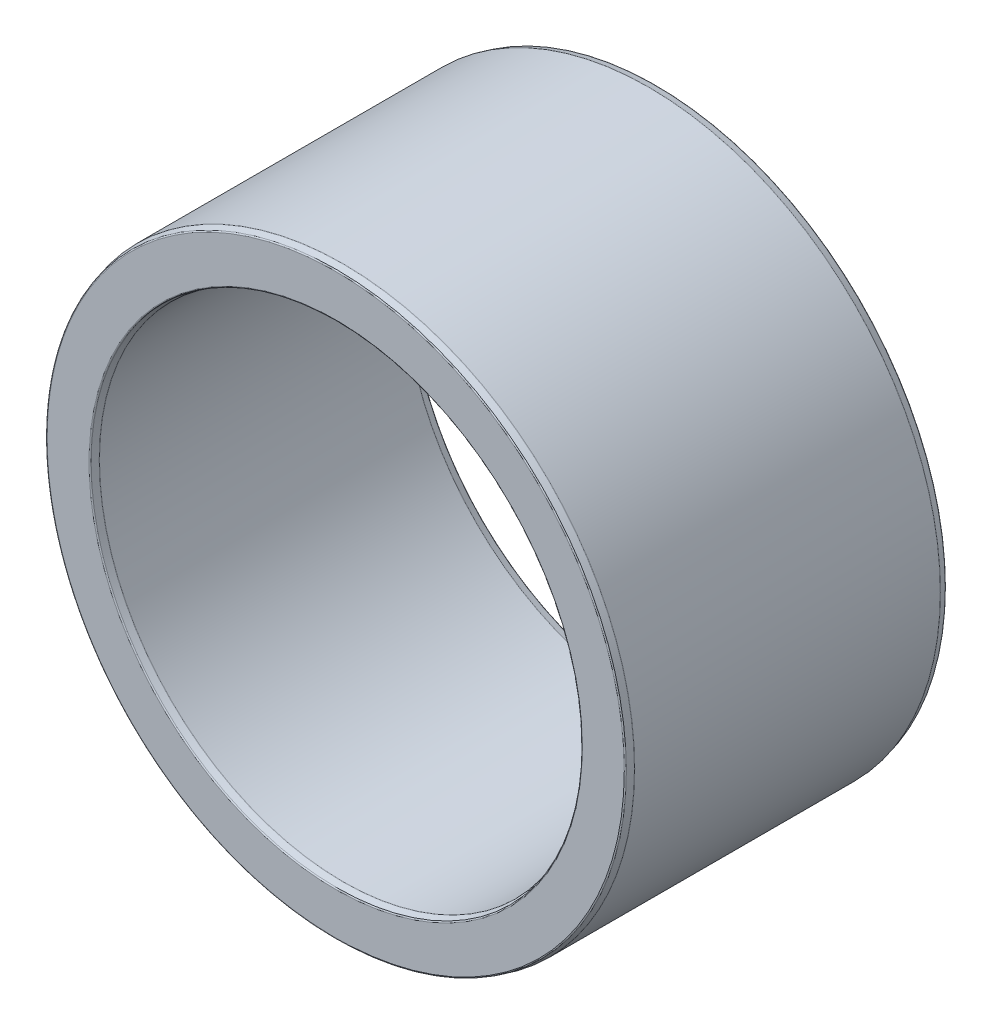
ISO-10303-21;
HEADER;
FILE_DESCRIPTION(('STEP AP214'),'2;1');
FILE_NAME('part.step','',(''),(''),'','','');
FILE_SCHEMA(('AUTOMOTIVE_DESIGN { 1 0 10303 214 1 1 1 1 }'));
ENDSEC;
DATA;
#1=APPLICATION_CONTEXT('core data for automotive mechanical design processes');
#2=APPLICATION_PROTOCOL_DEFINITION('international standard','automotive_design',2000,#1);
#3=PRODUCT_CONTEXT('',#1,'mechanical');
#4=PRODUCT('Part','Part','',(#3));
#5=PRODUCT_RELATED_PRODUCT_CATEGORY('part','',(#4));
#6=PRODUCT_DEFINITION_FORMATION('','',#4);
#7=PRODUCT_DEFINITION_CONTEXT('part definition',#1,'design');
#8=PRODUCT_DEFINITION('design','',#6,#7);
#9=PRODUCT_DEFINITION_SHAPE('','',#8);
#10=(LENGTH_UNIT() NAMED_UNIT(*) SI_UNIT(.MILLI.,.METRE.));
#11=(NAMED_UNIT(*) PLANE_ANGLE_UNIT() SI_UNIT($,.RADIAN.));
#12=(NAMED_UNIT(*) SI_UNIT($,.STERADIAN.) SOLID_ANGLE_UNIT());
#13=UNCERTAINTY_MEASURE_WITH_UNIT(LENGTH_MEASURE(1.E-05),#10,'distance_accuracy_value','');
#14=(GEOMETRIC_REPRESENTATION_CONTEXT(3) GLOBAL_UNCERTAINTY_ASSIGNED_CONTEXT((#13)) GLOBAL_UNIT_ASSIGNED_CONTEXT((#10,
#11,#12)) REPRESENTATION_CONTEXT('',''));
#15=CARTESIAN_POINT('',(0.,0.,0.));
#16=DIRECTION('',(0.,0.,1.));
#17=DIRECTION('',(1.,0.,0.));
#18=AXIS2_PLACEMENT_3D('',#15,#16,#17);
#19=CARTESIAN_POINT('',(0.,0.,16.4973));
#20=DIRECTION('',(0.,0.,1.));
#21=DIRECTION('',(1.,0.,0.));
#22=AXIS2_PLACEMENT_3D('',#19,#20,#21);
#23=PLANE('',#22);
#24=CARTESIAN_POINT('',(0.,0.,16.4973));
#25=DIRECTION('',(0.,0.,1.));
#26=DIRECTION('',(1.,0.,0.));
#27=AXIS2_PLACEMENT_3D('',#24,#25,#26);
#28=CIRCLE('',#27,29.6983721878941);
#29=CARTESIAN_POINT('',(29.6983721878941,0.,16.4973));
#30=VERTEX_POINT('',#29);
#31=EDGE_CURVE('E49',#30,#30,#28,.T.);
#32=ORIENTED_EDGE('',*,*,#31,.T.);
#33=EDGE_LOOP('',(#32));
#34=FACE_BOUND('',#33,.T.);
#35=CARTESIAN_POINT('',(0.,0.,16.4973));
#36=DIRECTION('',(0.,0.,1.));
#37=DIRECTION('',(1.,0.,0.));
#38=AXIS2_PLACEMENT_3D('',#35,#36,#37);
#39=CIRCLE('',#38,25.3866278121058);
#40=CARTESIAN_POINT('',(25.3866278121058,0.,16.4973));
#41=VERTEX_POINT('',#40);
#42=EDGE_CURVE('E54',#41,#41,#39,.F.);
#43=ORIENTED_EDGE('',*,*,#42,.T.);
#44=EDGE_LOOP('',(#43));
#45=FACE_BOUND('',#44,.T.);
#46=ADVANCED_FACE('F34',(#34,#45),#23,.T.);
#47=CARTESIAN_POINT('',(0.,0.,-16.4973));
#48=DIRECTION('',(0.,0.,1.));
#49=DIRECTION('',(1.,0.,0.));
#50=AXIS2_PLACEMENT_3D('',#47,#48,#49);
#51=PLANE('',#50);
#52=CARTESIAN_POINT('',(0.,0.,-16.4973));
#53=DIRECTION('',(0.,0.,1.));
#54=DIRECTION('',(1.,0.,0.));
#55=AXIS2_PLACEMENT_3D('',#52,#53,#54);
#56=CIRCLE('',#55,25.3866278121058);
#57=CARTESIAN_POINT('',(25.3866278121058,0.,-16.4973));
#58=VERTEX_POINT('',#57);
#59=EDGE_CURVE('E98',#58,#58,#56,.T.);
#60=ORIENTED_EDGE('',*,*,#59,.T.);
#61=EDGE_LOOP('',(#60));
#62=FACE_BOUND('',#61,.T.);
#63=CARTESIAN_POINT('',(0.,0.,-16.4973));
#64=DIRECTION('',(0.,0.,1.));
#65=DIRECTION('',(1.,0.,0.));
#66=AXIS2_PLACEMENT_3D('',#63,#64,#65);
#67=CIRCLE('',#66,29.6983721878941);
#68=CARTESIAN_POINT('',(29.6983721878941,0.,-16.4973));
#69=VERTEX_POINT('',#68);
#70=EDGE_CURVE('E102',#69,#69,#67,.F.);
#71=ORIENTED_EDGE('',*,*,#70,.T.);
#72=EDGE_LOOP('',(#71));
#73=FACE_BOUND('',#72,.T.);
#74=ADVANCED_FACE('F107',(#62,#73),#51,.F.);
#75=CARTESIAN_POINT('',(0.,0.,16.4973));
#76=DIRECTION('',(0.,0.,-1.));
#77=DIRECTION('',(-1.,0.,0.));
#78=AXIS2_PLACEMENT_3D('',#75,#76,#77);
#79=CYLINDRICAL_SURFACE('',#78,30.);
#80=CARTESIAN_POINT('',(0.,0.,-15.7185801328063));
#81=DIRECTION('',(0.,0.,-1.));
#82=DIRECTION('',(-1.,0.,0.));
#83=AXIS2_PLACEMENT_3D('',#80,#81,#82);
#84=CIRCLE('',#83,30.);
#85=CARTESIAN_POINT('',(-30.,0.,-15.7185801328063));
#86=VERTEX_POINT('',#85);
#87=EDGE_CURVE('E75',#86,#86,#84,.F.);
#88=ORIENTED_EDGE('',*,*,#87,.T.);
#89=EDGE_LOOP('',(#88));
#90=FACE_BOUND('',#89,.T.);
#91=CARTESIAN_POINT('',(0.,0.,15.7185801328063));
#92=DIRECTION('',(0.,0.,1.));
#93=DIRECTION('',(1.,0.,0.));
#94=AXIS2_PLACEMENT_3D('',#91,#92,#93);
#95=CIRCLE('',#94,30.);
#96=CARTESIAN_POINT('',(30.,0.,15.7185801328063));
#97=VERTEX_POINT('',#96);
#98=EDGE_CURVE('E79',#97,#97,#95,.F.);
#99=ORIENTED_EDGE('',*,*,#98,.T.);
#100=EDGE_LOOP('',(#99));
#101=FACE_BOUND('',#100,.T.);
#102=ADVANCED_FACE('F132',(#90,#101),#79,.T.);
#103=CARTESIAN_POINT('',(0.,0.,16.4973));
#104=DIRECTION('',(0.,0.,-1.));
#105=DIRECTION('',(-1.,0.,0.));
#106=AXIS2_PLACEMENT_3D('',#103,#104,#105);
#107=CYLINDRICAL_SURFACE('',#106,25.085);
#108=CARTESIAN_POINT('',(0.,0.,-15.7185801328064));
#109=DIRECTION('',(0.,0.,1.));
#110=DIRECTION('',(1.,0.,0.));
#111=AXIS2_PLACEMENT_3D('',#108,#109,#110);
#112=CIRCLE('',#111,25.085);
#113=CARTESIAN_POINT('',(25.085,0.,-15.7185801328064));
#114=VERTEX_POINT('',#113);
#115=EDGE_CURVE('E83',#114,#114,#112,.F.);
#116=ORIENTED_EDGE('',*,*,#115,.T.);
#117=EDGE_LOOP('',(#116));
#118=FACE_BOUND('',#117,.T.);
#119=CARTESIAN_POINT('',(0.,0.,15.7185801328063));
#120=DIRECTION('',(0.,0.,-1.));
#121=DIRECTION('',(-1.,0.,0.));
#122=AXIS2_PLACEMENT_3D('',#119,#120,#121);
#123=CIRCLE('',#122,25.085);
#124=CARTESIAN_POINT('',(-25.085,0.,15.7185801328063));
#125=VERTEX_POINT('',#124);
#126=EDGE_CURVE('E87',#125,#125,#123,.F.);
#127=ORIENTED_EDGE('',*,*,#126,.T.);
#128=EDGE_LOOP('',(#127));
#129=FACE_BOUND('',#128,.T.);
#130=ADVANCED_FACE('F137',(#118,#129),#107,.F.);
#131=CARTESIAN_POINT('',(0.,0.,15.7352999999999));
#132=DIRECTION('',(0.,0.,1.));
#133=DIRECTION('',(1.,0.,0.));
#134=AXIS2_PLACEMENT_3D('',#131,#132,#133);
#135=CONICAL_SURFACE('',#134,25.085,0.261799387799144);
#136=CARTESIAN_POINT('',(0.,0.,15.7514501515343));
#137=DIRECTION('',(0.,0.,-1.));
#138=DIRECTION('',(-1.,0.,0.));
#139=AXIS2_PLACEMENT_3D('',#136,#137,#138);
#140=CIRCLE('',#139,25.0893274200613);
#141=CARTESIAN_POINT('',(-25.0893274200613,0.,15.7514501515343));
#142=VERTEX_POINT('',#141);
#143=EDGE_CURVE('E10',#142,#142,#140,.T.);
#144=ORIENTED_EDGE('',*,*,#143,.T.);
#145=EDGE_LOOP('',(#144));
#146=FACE_BOUND('',#145,.T.);
#147=CARTESIAN_POINT('',(0.,0.,16.403170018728));
#148=DIRECTION('',(0.,0.,-1.));
#149=DIRECTION('',(-1.,0.,0.));
#150=AXIS2_PLACEMENT_3D('',#147,#148,#149);
#151=CIRCLE('',#150,25.2639552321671);
#152=CARTESIAN_POINT('',(-25.2639552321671,0.,16.403170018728));
#153=VERTEX_POINT('',#152);
#154=EDGE_CURVE('E42',#153,#153,#151,.F.);
#155=ORIENTED_EDGE('',*,*,#154,.T.);
#156=EDGE_LOOP('',(#155));
#157=FACE_BOUND('',#156,.T.);
#158=ADVANCED_FACE('F142',(#146,#157),#135,.F.);
#159=CARTESIAN_POINT('',(0.,0.,-15.7352999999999));
#160=DIRECTION('',(0.,0.,1.));
#161=DIRECTION('',(1.,0.,0.));
#162=AXIS2_PLACEMENT_3D('',#159,#160,#161);
#163=CONICAL_SURFACE('',#162,30.,0.261799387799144);
#164=CARTESIAN_POINT('',(0.,0.,-15.7514501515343));
#165=DIRECTION('',(0.,0.,1.));
#166=DIRECTION('',(1.,0.,0.));
#167=AXIS2_PLACEMENT_3D('',#164,#165,#166);
#168=CIRCLE('',#167,29.9956725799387);
#169=CARTESIAN_POINT('',(29.9956725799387,0.,-15.7514501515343));
#170=VERTEX_POINT('',#169);
#171=EDGE_CURVE('E67',#170,#170,#168,.F.);
#172=ORIENTED_EDGE('',*,*,#171,.T.);
#173=EDGE_LOOP('',(#172));
#174=FACE_BOUND('',#173,.T.);
#175=CARTESIAN_POINT('',(0.,0.,-16.403170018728));
#176=DIRECTION('',(0.,0.,1.));
#177=DIRECTION('',(1.,0.,0.));
#178=AXIS2_PLACEMENT_3D('',#175,#176,#177);
#179=CIRCLE('',#178,29.8210447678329);
#180=CARTESIAN_POINT('',(29.8210447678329,0.,-16.403170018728));
#181=VERTEX_POINT('',#180);
#182=EDGE_CURVE('E71',#181,#181,#179,.T.);
#183=ORIENTED_EDGE('',*,*,#182,.T.);
#184=EDGE_LOOP('',(#183));
#185=FACE_BOUND('',#184,.T.);
#186=ADVANCED_FACE('F145',(#174,#185),#163,.T.);
#187=CARTESIAN_POINT('',(0.,0.,-16.4973));
#188=DIRECTION('',(0.,0.,-1.));
#189=DIRECTION('',(-1.,0.,0.));
#190=AXIS2_PLACEMENT_3D('',#187,#188,#189);
#191=CONICAL_SURFACE('',#190,25.2891772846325,0.261799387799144);
#192=CARTESIAN_POINT('',(0.,0.,-16.403170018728));
#193=DIRECTION('',(0.,0.,-1.));
#194=DIRECTION('',(-1.,0.,0.));
#195=AXIS2_PLACEMENT_3D('',#192,#193,#194);
#196=CIRCLE('',#195,25.2639552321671);
#197=CARTESIAN_POINT('',(-25.2639552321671,0.,-16.403170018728));
#198=VERTEX_POINT('',#197);
#199=EDGE_CURVE('E90',#198,#198,#196,.T.);
#200=ORIENTED_EDGE('',*,*,#199,.T.);
#201=EDGE_LOOP('',(#200));
#202=FACE_BOUND('',#201,.T.);
#203=CARTESIAN_POINT('',(0.,0.,-15.7514501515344));
#204=DIRECTION('',(0.,0.,1.));
#205=DIRECTION('',(1.,0.,0.));
#206=AXIS2_PLACEMENT_3D('',#203,#204,#205);
#207=CIRCLE('',#206,25.0893274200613);
#208=CARTESIAN_POINT('',(25.0893274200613,0.,-15.7514501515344));
#209=VERTEX_POINT('',#208);
#210=EDGE_CURVE('E94',#209,#209,#207,.T.);
#211=ORIENTED_EDGE('',*,*,#210,.T.);
#212=EDGE_LOOP('',(#211));
#213=FACE_BOUND('',#212,.T.);
#214=ADVANCED_FACE('F148',(#202,#213),#191,.F.);
#215=CARTESIAN_POINT('',(0.,0.,16.4973));
#216=DIRECTION('',(0.,0.,-1.));
#217=DIRECTION('',(-1.,0.,0.));
#218=AXIS2_PLACEMENT_3D('',#215,#216,#217);
#219=CONICAL_SURFACE('',#218,29.7958227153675,0.261799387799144);
#220=CARTESIAN_POINT('',(0.,0.,15.7514501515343));
#221=DIRECTION('',(0.,0.,-1.));
#222=DIRECTION('',(-1.,0.,0.));
#223=AXIS2_PLACEMENT_3D('',#220,#221,#222);
#224=CIRCLE('',#223,29.9956725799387);
#225=CARTESIAN_POINT('',(-29.9956725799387,0.,15.7514501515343));
#226=VERTEX_POINT('',#225);
#227=EDGE_CURVE('E59',#226,#226,#224,.F.);
#228=ORIENTED_EDGE('',*,*,#227,.T.);
#229=EDGE_LOOP('',(#228));
#230=FACE_BOUND('',#229,.T.);
#231=CARTESIAN_POINT('',(0.,0.,16.403170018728));
#232=DIRECTION('',(0.,0.,1.));
#233=DIRECTION('',(1.,0.,0.));
#234=AXIS2_PLACEMENT_3D('',#231,#232,#233);
#235=CIRCLE('',#234,29.8210447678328);
#236=CARTESIAN_POINT('',(29.8210447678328,0.,16.403170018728));
#237=VERTEX_POINT('',#236);
#238=EDGE_CURVE('E63',#237,#237,#235,.F.);
#239=ORIENTED_EDGE('',*,*,#238,.T.);
#240=EDGE_LOOP('',(#239));
#241=FACE_BOUND('',#240,.T.);
#242=ADVANCED_FACE('F152',(#230,#241),#219,.T.);
#243=CARTESIAN_POINT('',(0.,0.,-16.3703));
#244=DIRECTION('',(0.,0.,1.));
#245=DIRECTION('',(1.,0.,0.));
#246=AXIS2_PLACEMENT_3D('',#243,#244,#245);
#247=TOROIDAL_SURFACE('',#246,25.3866278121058,0.127);
#248=ORIENTED_EDGE('',*,*,#199,.F.);
#249=EDGE_LOOP('',(#248));
#250=FACE_BOUND('',#249,.T.);
#251=ORIENTED_EDGE('',*,*,#59,.F.);
#252=EDGE_LOOP('',(#251));
#253=FACE_BOUND('',#252,.T.);
#254=ADVANCED_FACE('F156',(#250,#253),#247,.T.);
#255=CARTESIAN_POINT('',(0.,0.,-15.7185801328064));
#256=DIRECTION('',(0.,0.,1.));
#257=DIRECTION('',(1.,0.,0.));
#258=AXIS2_PLACEMENT_3D('',#255,#256,#257);
#259=TOROIDAL_SURFACE('',#258,25.212,0.127);
#260=ORIENTED_EDGE('',*,*,#210,.F.);
#261=EDGE_LOOP('',(#260));
#262=FACE_BOUND('',#261,.T.);
#263=ORIENTED_EDGE('',*,*,#115,.F.);
#264=EDGE_LOOP('',(#263));
#265=FACE_BOUND('',#264,.T.);
#266=ADVANCED_FACE('F122',(#262,#265),#259,.T.);
#267=CARTESIAN_POINT('',(0.,0.,-15.7185801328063));
#268=DIRECTION('',(0.,0.,-1.));
#269=DIRECTION('',(-1.,0.,0.));
#270=AXIS2_PLACEMENT_3D('',#267,#268,#269);
#271=TOROIDAL_SURFACE('',#270,29.873,0.127);
#272=ORIENTED_EDGE('',*,*,#171,.F.);
#273=EDGE_LOOP('',(#272));
#274=FACE_BOUND('',#273,.T.);
#275=ORIENTED_EDGE('',*,*,#87,.F.);
#276=EDGE_LOOP('',(#275));
#277=FACE_BOUND('',#276,.T.);
#278=ADVANCED_FACE('F112',(#274,#277),#271,.T.);
#279=CARTESIAN_POINT('',(0.,0.,-16.3703));
#280=DIRECTION('',(0.,0.,1.));
#281=DIRECTION('',(1.,0.,0.));
#282=AXIS2_PLACEMENT_3D('',#279,#280,#281);
#283=TOROIDAL_SURFACE('',#282,29.6983721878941,0.127);
#284=ORIENTED_EDGE('',*,*,#182,.F.);
#285=EDGE_LOOP('',(#284));
#286=FACE_BOUND('',#285,.T.);
#287=ORIENTED_EDGE('',*,*,#70,.F.);
#288=EDGE_LOOP('',(#287));
#289=FACE_BOUND('',#288,.T.);
#290=ADVANCED_FACE('F109',(#286,#289),#283,.T.);
#291=CARTESIAN_POINT('',(0.,0.,15.7185801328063));
#292=DIRECTION('',(0.,0.,1.));
#293=DIRECTION('',(1.,0.,0.));
#294=AXIS2_PLACEMENT_3D('',#291,#292,#293);
#295=TOROIDAL_SURFACE('',#294,29.873,0.127);
#296=ORIENTED_EDGE('',*,*,#227,.F.);
#297=EDGE_LOOP('',(#296));
#298=FACE_BOUND('',#297,.T.);
#299=ORIENTED_EDGE('',*,*,#98,.F.);
#300=EDGE_LOOP('',(#299));
#301=FACE_BOUND('',#300,.T.);
#302=ADVANCED_FACE('F111',(#298,#301),#295,.T.);
#303=CARTESIAN_POINT('',(0.,0.,16.3703));
#304=DIRECTION('',(0.,0.,1.));
#305=DIRECTION('',(1.,0.,0.));
#306=AXIS2_PLACEMENT_3D('',#303,#304,#305);
#307=TOROIDAL_SURFACE('',#306,29.6983721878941,0.127);
#308=ORIENTED_EDGE('',*,*,#238,.F.);
#309=EDGE_LOOP('',(#308));
#310=FACE_BOUND('',#309,.T.);
#311=ORIENTED_EDGE('',*,*,#31,.F.);
#312=EDGE_LOOP('',(#311));
#313=FACE_BOUND('',#312,.T.);
#314=ADVANCED_FACE('F119',(#310,#313),#307,.T.);
#315=CARTESIAN_POINT('',(0.,0.,15.7185801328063));
#316=DIRECTION('',(0.,0.,-1.));
#317=DIRECTION('',(-1.,0.,0.));
#318=AXIS2_PLACEMENT_3D('',#315,#316,#317);
#319=TOROIDAL_SURFACE('',#318,25.212,0.127);
#320=ORIENTED_EDGE('',*,*,#143,.F.);
#321=EDGE_LOOP('',(#320));
#322=FACE_BOUND('',#321,.T.);
#323=ORIENTED_EDGE('',*,*,#126,.F.);
#324=EDGE_LOOP('',(#323));
#325=FACE_BOUND('',#324,.T.);
#326=ADVANCED_FACE('F173',(#322,#325),#319,.T.);
#327=CARTESIAN_POINT('',(0.,0.,16.3703));
#328=DIRECTION('',(0.,0.,1.));
#329=DIRECTION('',(1.,0.,0.));
#330=AXIS2_PLACEMENT_3D('',#327,#328,#329);
#331=TOROIDAL_SURFACE('',#330,25.3866278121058,0.127);
#332=ORIENTED_EDGE('',*,*,#154,.F.);
#333=EDGE_LOOP('',(#332));
#334=FACE_BOUND('',#333,.T.);
#335=ORIENTED_EDGE('',*,*,#42,.F.);
#336=EDGE_LOOP('',(#335));
#337=FACE_BOUND('',#336,.T.);
#338=ADVANCED_FACE('F36',(#334,#337),#331,.T.);
#339=CLOSED_SHELL('',(#46,#74,#102,#130,#158,#186,#214,#242,#254,#266,#278,#290,#302,#314,#326,#338));
#340=MANIFOLD_SOLID_BREP('B2',#339);
#341=ADVANCED_BREP_SHAPE_REPRESENTATION('',(#18,#340),#14);
#342=SHAPE_DEFINITION_REPRESENTATION(#9,#341);
ENDSEC;
END-ISO-10303-21;
